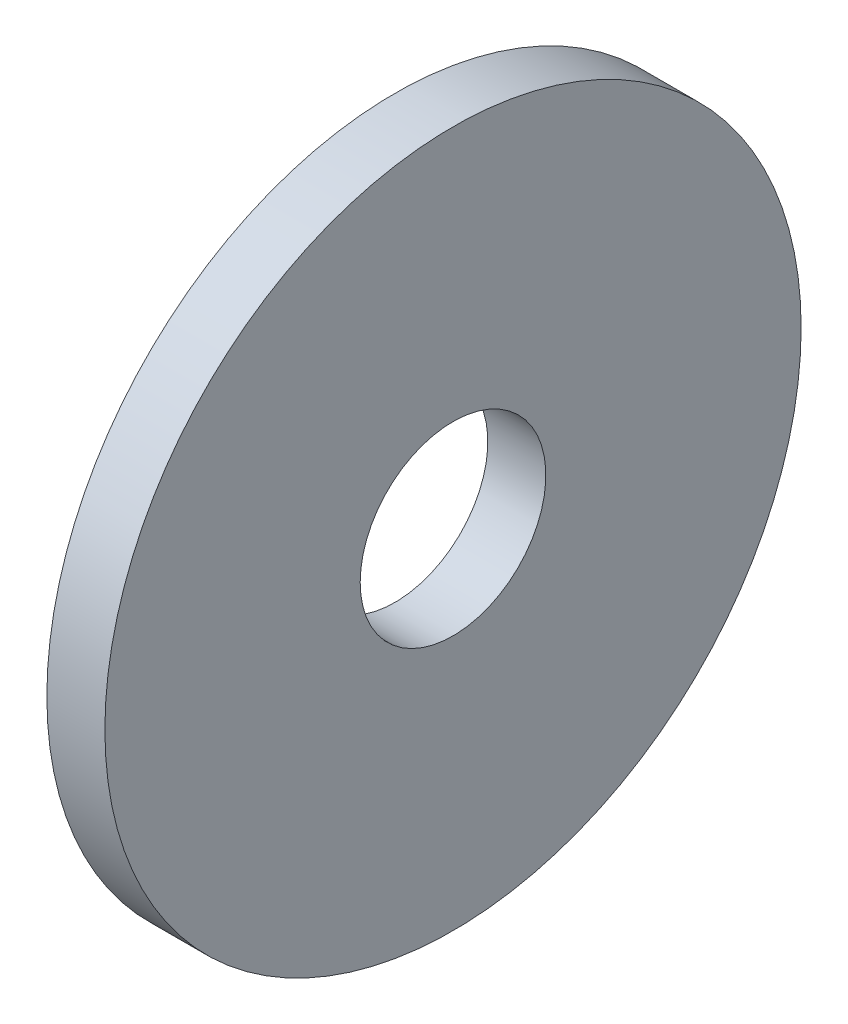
from build123d import *

# Parameters (mm, degrees)
ESQUISSE1_W = 2
ESQUISSE1_H = 8.8


with BuildPart() as part:
    # Esquisse1 → Base-R_volution (revolve)
    with BuildSketch(Plane(origin=(0, 0, 0), x_dir=(1, 0, 0), z_dir=(0, 1, 0)), mode=Mode.PRIVATE) as base_r_volution_sk:
        with Locations((1, 7.6)):
            Rectangle(ESQUISSE1_W, ESQUISSE1_H)
    revolve(base_r_volution_sk.sketch.rotate(Axis((0, 0, 0), (1, 0, 0)), 180), axis=Axis((0, 0, 0), (1, 0, 0)))


solid = part.part
